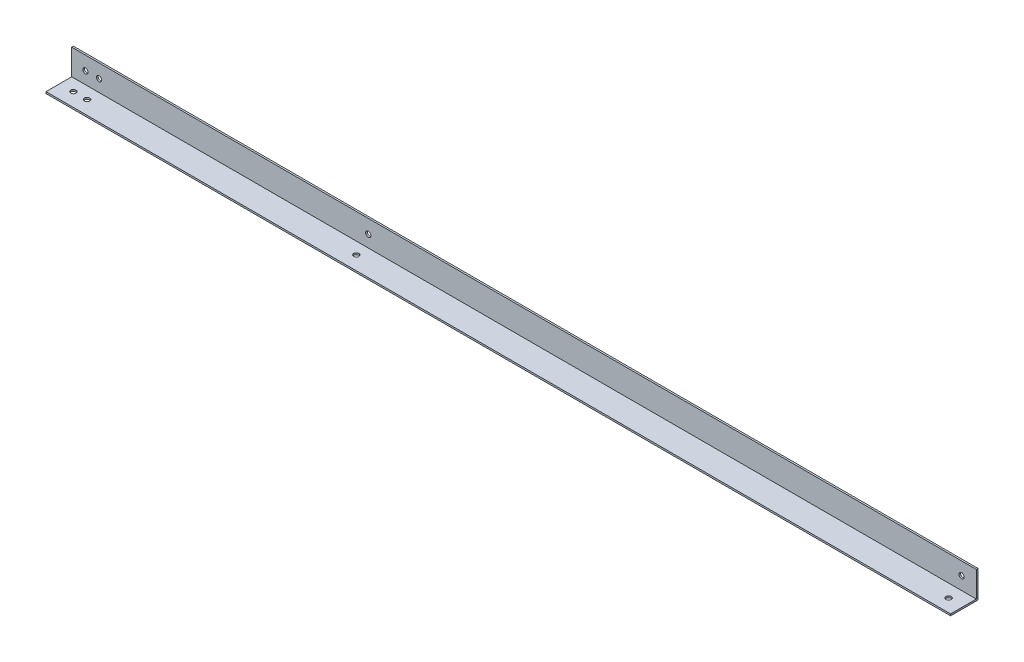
ISO-10303-21;
HEADER;
FILE_DESCRIPTION(('STEP AP214'),'2;1');
FILE_NAME('part.step','',(''),(''),'','','');
FILE_SCHEMA(('AUTOMOTIVE_DESIGN { 1 0 10303 214 1 1 1 1 }'));
ENDSEC;
DATA;
#1=APPLICATION_CONTEXT('core data for automotive mechanical design processes');
#2=APPLICATION_PROTOCOL_DEFINITION('international standard','automotive_design',2000,#1);
#3=PRODUCT_CONTEXT('',#1,'mechanical');
#4=PRODUCT('Part','Part','',(#3));
#5=PRODUCT_RELATED_PRODUCT_CATEGORY('part','',(#4));
#6=PRODUCT_DEFINITION_FORMATION('','',#4);
#7=PRODUCT_DEFINITION_CONTEXT('part definition',#1,'design');
#8=PRODUCT_DEFINITION('design','',#6,#7);
#9=PRODUCT_DEFINITION_SHAPE('','',#8);
#10=(LENGTH_UNIT() NAMED_UNIT(*) SI_UNIT(.MILLI.,.METRE.));
#11=(NAMED_UNIT(*) PLANE_ANGLE_UNIT() SI_UNIT($,.RADIAN.));
#12=(NAMED_UNIT(*) SI_UNIT($,.STERADIAN.) SOLID_ANGLE_UNIT());
#13=UNCERTAINTY_MEASURE_WITH_UNIT(LENGTH_MEASURE(1.E-05),#10,'distance_accuracy_value','');
#14=(GEOMETRIC_REPRESENTATION_CONTEXT(3) GLOBAL_UNCERTAINTY_ASSIGNED_CONTEXT((#13)) GLOBAL_UNIT_ASSIGNED_CONTEXT((#10,
#11,#12)) REPRESENTATION_CONTEXT('',''));
#15=CARTESIAN_POINT('',(0.,0.,0.));
#16=DIRECTION('',(0.,0.,1.));
#17=DIRECTION('',(1.,0.,0.));
#18=AXIS2_PLACEMENT_3D('',#15,#16,#17);
#19=CARTESIAN_POINT('',(419.1,0.,0.));
#20=DIRECTION('',(0.,1.,0.));
#21=DIRECTION('',(0.,0.,1.));
#22=AXIS2_PLACEMENT_3D('',#19,#20,#21);
#23=PLANE('',#22);
#24=CARTESIAN_POINT('',(405.3836057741,0.,13.49375));
#25=DIRECTION('',(0.,1.,0.));
#26=DIRECTION('',(0.,0.,1.));
#27=AXIS2_PLACEMENT_3D('',#24,#25,#26);
#28=CIRCLE('',#27,2.42569999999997);
#29=CARTESIAN_POINT('',(405.3836057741,0.,15.91945));
#30=VERTEX_POINT('',#29);
#31=EDGE_CURVE('E147',#30,#30,#28,.T.);
#32=ORIENTED_EDGE('',*,*,#31,.T.);
#33=EDGE_LOOP('',(#32));
#34=FACE_BOUND('',#33,.T.);
#35=CARTESIAN_POINT('',(-393.7,0.,12.7));
#36=DIRECTION('',(0.,1.,0.));
#37=DIRECTION('',(0.,0.,1.));
#38=AXIS2_PLACEMENT_3D('',#35,#36,#37);
#39=CIRCLE('',#38,2.42569999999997);
#40=CARTESIAN_POINT('',(-393.7,0.,15.1257));
#41=VERTEX_POINT('',#40);
#42=EDGE_CURVE('E172',#41,#41,#39,.T.);
#43=ORIENTED_EDGE('',*,*,#42,.T.);
#44=EDGE_LOOP('',(#43));
#45=FACE_BOUND('',#44,.T.);
#46=CARTESIAN_POINT('',(-144.27708,0.,12.7));
#47=DIRECTION('',(0.,1.,0.));
#48=DIRECTION('',(0.,0.,1.));
#49=AXIS2_PLACEMENT_3D('',#46,#47,#48);
#50=CIRCLE('',#49,2.4257);
#51=CARTESIAN_POINT('',(-144.27708,0.,15.1257));
#52=VERTEX_POINT('',#51);
#53=EDGE_CURVE('E169',#52,#52,#50,.T.);
#54=ORIENTED_EDGE('',*,*,#53,.T.);
#55=EDGE_LOOP('',(#54));
#56=FACE_BOUND('',#55,.T.);
#57=CARTESIAN_POINT('',(-406.4,0.,12.7));
#58=DIRECTION('',(0.,1.,0.));
#59=DIRECTION('',(0.,0.,1.));
#60=AXIS2_PLACEMENT_3D('',#57,#58,#59);
#61=CIRCLE('',#60,2.42569999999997);
#62=CARTESIAN_POINT('',(-406.4,0.,15.1257));
#63=VERTEX_POINT('',#62);
#64=EDGE_CURVE('E164',#63,#63,#61,.T.);
#65=ORIENTED_EDGE('',*,*,#64,.T.);
#66=EDGE_LOOP('',(#65));
#67=FACE_BOUND('',#66,.T.);
#68=DIRECTION('',(0.,0.,-1.));
#69=VECTOR('',#68,1.);
#70=CARTESIAN_POINT('',(-419.1,0.,0.));
#71=LINE('',#70,#69);
#72=CARTESIAN_POINT('',(-419.1,0.,25.4));
#73=VERTEX_POINT('',#72);
#74=CARTESIAN_POINT('',(-419.1,0.,0.));
#75=VERTEX_POINT('',#74);
#76=EDGE_CURVE('E123',#73,#75,#71,.T.);
#77=ORIENTED_EDGE('',*,*,#76,.T.);
#78=DIRECTION('',(-1.,0.,0.));
#79=VECTOR('',#78,1.);
#80=CARTESIAN_POINT('',(419.1,0.,0.));
#81=LINE('',#80,#79);
#82=CARTESIAN_POINT('',(419.1,0.,0.));
#83=VERTEX_POINT('',#82);
#84=EDGE_CURVE('E11',#83,#75,#81,.T.);
#85=ORIENTED_EDGE('',*,*,#84,.F.);
#86=DIRECTION('',(0.,0.,-1.));
#87=VECTOR('',#86,1.);
#88=CARTESIAN_POINT('',(419.1,0.,0.));
#89=LINE('',#88,#87);
#90=CARTESIAN_POINT('',(419.1,0.,25.4));
#91=VERTEX_POINT('',#90);
#92=EDGE_CURVE('E138',#91,#83,#89,.T.);
#93=ORIENTED_EDGE('',*,*,#92,.F.);
#94=DIRECTION('',(-1.,0.,0.));
#95=VECTOR('',#94,1.);
#96=CARTESIAN_POINT('',(419.1,0.,25.4));
#97=LINE('',#96,#95);
#98=EDGE_CURVE('E122',#91,#73,#97,.T.);
#99=ORIENTED_EDGE('',*,*,#98,.T.);
#100=EDGE_LOOP('',(#77,#85,#93,#99));
#101=FACE_BOUND('',#100,.T.);
#102=ADVANCED_FACE('F39',(#34,#45,#56,#67,#101),#23,.F.);
#103=CARTESIAN_POINT('',(419.1,0.,0.));
#104=DIRECTION('',(0.,0.,1.));
#105=DIRECTION('',(1.,0.,0.));
#106=AXIS2_PLACEMENT_3D('',#103,#104,#105);
#107=PLANE('',#106);
#108=CARTESIAN_POINT('',(405.3836057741,13.49375,0.));
#109=DIRECTION('',(0.,0.,-1.));
#110=DIRECTION('',(0.,1.,0.));
#111=AXIS2_PLACEMENT_3D('',#108,#109,#110);
#112=CIRCLE('',#111,2.42569999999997);
#113=CARTESIAN_POINT('',(405.3836057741,15.91945,0.));
#114=VERTEX_POINT('',#113);
#115=EDGE_CURVE('E156',#114,#114,#112,.T.);
#116=ORIENTED_EDGE('',*,*,#115,.F.);
#117=EDGE_LOOP('',(#116));
#118=FACE_BOUND('',#117,.T.);
#119=CARTESIAN_POINT('',(-393.7,12.7,0.));
#120=DIRECTION('',(0.,0.,-1.));
#121=DIRECTION('',(0.,1.,0.));
#122=AXIS2_PLACEMENT_3D('',#119,#120,#121);
#123=CIRCLE('',#122,2.42569999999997);
#124=CARTESIAN_POINT('',(-393.7,15.1257,0.));
#125=VERTEX_POINT('',#124);
#126=EDGE_CURVE('E258',#125,#125,#123,.T.);
#127=ORIENTED_EDGE('',*,*,#126,.F.);
#128=EDGE_LOOP('',(#127));
#129=FACE_BOUND('',#128,.T.);
#130=CARTESIAN_POINT('',(-144.27708,12.7,0.));
#131=DIRECTION('',(0.,0.,-1.));
#132=DIRECTION('',(0.,1.,0.));
#133=AXIS2_PLACEMENT_3D('',#130,#131,#132);
#134=CIRCLE('',#133,2.4257);
#135=CARTESIAN_POINT('',(-144.27708,15.1257,0.));
#136=VERTEX_POINT('',#135);
#137=EDGE_CURVE('E263',#136,#136,#134,.T.);
#138=ORIENTED_EDGE('',*,*,#137,.F.);
#139=EDGE_LOOP('',(#138));
#140=FACE_BOUND('',#139,.T.);
#141=CARTESIAN_POINT('',(-406.4,12.7,0.));
#142=DIRECTION('',(0.,0.,-1.));
#143=DIRECTION('',(0.,1.,0.));
#144=AXIS2_PLACEMENT_3D('',#141,#142,#143);
#145=CIRCLE('',#144,2.42569999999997);
#146=CARTESIAN_POINT('',(-406.4,15.1257,0.));
#147=VERTEX_POINT('',#146);
#148=EDGE_CURVE('E266',#147,#147,#145,.T.);
#149=ORIENTED_EDGE('',*,*,#148,.F.);
#150=EDGE_LOOP('',(#149));
#151=FACE_BOUND('',#150,.T.);
#152=DIRECTION('',(0.,1.,0.));
#153=VECTOR('',#152,1.);
#154=CARTESIAN_POINT('',(-419.1,0.,0.));
#155=LINE('',#154,#153);
#156=CARTESIAN_POINT('',(-419.1,25.4,0.));
#157=VERTEX_POINT('',#156);
#158=EDGE_CURVE('E129',#75,#157,#155,.T.);
#159=ORIENTED_EDGE('',*,*,#158,.T.);
#160=DIRECTION('',(-1.,0.,0.));
#161=VECTOR('',#160,1.);
#162=CARTESIAN_POINT('',(419.1,25.4,0.));
#163=LINE('',#162,#161);
#164=CARTESIAN_POINT('',(419.1,25.4,0.));
#165=VERTEX_POINT('',#164);
#166=EDGE_CURVE('E48',#165,#157,#163,.T.);
#167=ORIENTED_EDGE('',*,*,#166,.F.);
#168=DIRECTION('',(0.,1.,0.));
#169=VECTOR('',#168,1.);
#170=CARTESIAN_POINT('',(419.1,0.,0.));
#171=LINE('',#170,#169);
#172=EDGE_CURVE('E94',#83,#165,#171,.T.);
#173=ORIENTED_EDGE('',*,*,#172,.F.);
#174=ORIENTED_EDGE('',*,*,#84,.T.);
#175=EDGE_LOOP('',(#159,#167,#173,#174));
#176=FACE_BOUND('',#175,.T.);
#177=ADVANCED_FACE('F181',(#118,#129,#140,#151,#176),#107,.F.);
#178=CARTESIAN_POINT('',(419.1,25.4,0.));
#179=DIRECTION('',(0.,-1.,0.));
#180=DIRECTION('',(0.,0.,-1.));
#181=AXIS2_PLACEMENT_3D('',#178,#179,#180);
#182=PLANE('',#181);
#183=DIRECTION('',(0.,0.,1.));
#184=VECTOR('',#183,1.);
#185=CARTESIAN_POINT('',(-419.1,25.4,0.));
#186=LINE('',#185,#184);
#187=CARTESIAN_POINT('',(-419.1,25.4,1.5875));
#188=VERTEX_POINT('',#187);
#189=EDGE_CURVE('E132',#157,#188,#186,.T.);
#190=ORIENTED_EDGE('',*,*,#189,.T.);
#191=DIRECTION('',(-1.,0.,0.));
#192=VECTOR('',#191,1.);
#193=CARTESIAN_POINT('',(419.1,25.4,1.5875));
#194=LINE('',#193,#192);
#195=CARTESIAN_POINT('',(419.1,25.4,1.5875));
#196=VERTEX_POINT('',#195);
#197=EDGE_CURVE('E116',#196,#188,#194,.T.);
#198=ORIENTED_EDGE('',*,*,#197,.F.);
#199=DIRECTION('',(0.,0.,1.));
#200=VECTOR('',#199,1.);
#201=CARTESIAN_POINT('',(419.1,25.4,0.));
#202=LINE('',#201,#200);
#203=EDGE_CURVE('E110',#165,#196,#202,.T.);
#204=ORIENTED_EDGE('',*,*,#203,.F.);
#205=ORIENTED_EDGE('',*,*,#166,.T.);
#206=EDGE_LOOP('',(#190,#198,#204,#205));
#207=FACE_BOUND('',#206,.T.);
#208=ADVANCED_FACE('F183',(#207),#182,.F.);
#209=CARTESIAN_POINT('',(419.1,1.5875,1.5875));
#210=DIRECTION('',(0.,0.,-1.));
#211=DIRECTION('',(-1.,0.,0.));
#212=AXIS2_PLACEMENT_3D('',#209,#210,#211);
#213=PLANE('',#212);
#214=CARTESIAN_POINT('',(405.3836057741,13.49375,1.5875));
#215=DIRECTION('',(0.,0.,-1.));
#216=DIRECTION('',(-1.,0.,0.));
#217=AXIS2_PLACEMENT_3D('',#214,#215,#216);
#218=CIRCLE('',#217,2.42569999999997);
#219=CARTESIAN_POINT('',(402.9579057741,13.49375,1.5875));
#220=VERTEX_POINT('',#219);
#221=EDGE_CURVE('E45',#220,#220,#218,.T.);
#222=ORIENTED_EDGE('',*,*,#221,.T.);
#223=EDGE_LOOP('',(#222));
#224=FACE_BOUND('',#223,.T.);
#225=CARTESIAN_POINT('',(-393.7,12.7,1.5875));
#226=DIRECTION('',(0.,0.,-1.));
#227=DIRECTION('',(-1.,0.,0.));
#228=AXIS2_PLACEMENT_3D('',#225,#226,#227);
#229=CIRCLE('',#228,2.42569999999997);
#230=CARTESIAN_POINT('',(-396.1257,12.7,1.5875));
#231=VERTEX_POINT('',#230);
#232=EDGE_CURVE('E157',#231,#231,#229,.T.);
#233=ORIENTED_EDGE('',*,*,#232,.T.);
#234=EDGE_LOOP('',(#233));
#235=FACE_BOUND('',#234,.T.);
#236=CARTESIAN_POINT('',(-144.27708,12.7,1.5875));
#237=DIRECTION('',(0.,0.,-1.));
#238=DIRECTION('',(-1.,0.,0.));
#239=AXIS2_PLACEMENT_3D('',#236,#237,#238);
#240=CIRCLE('',#239,2.4257);
#241=CARTESIAN_POINT('',(-146.70278,12.7,1.5875));
#242=VERTEX_POINT('',#241);
#243=EDGE_CURVE('E160',#242,#242,#240,.T.);
#244=ORIENTED_EDGE('',*,*,#243,.T.);
#245=EDGE_LOOP('',(#244));
#246=FACE_BOUND('',#245,.T.);
#247=CARTESIAN_POINT('',(-406.4,12.7,1.5875));
#248=DIRECTION('',(0.,0.,-1.));
#249=DIRECTION('',(-1.,0.,0.));
#250=AXIS2_PLACEMENT_3D('',#247,#248,#249);
#251=CIRCLE('',#250,2.42569999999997);
#252=CARTESIAN_POINT('',(-408.8257,12.7,1.5875));
#253=VERTEX_POINT('',#252);
#254=EDGE_CURVE('E154',#253,#253,#251,.T.);
#255=ORIENTED_EDGE('',*,*,#254,.T.);
#256=EDGE_LOOP('',(#255));
#257=FACE_BOUND('',#256,.T.);
#258=DIRECTION('',(0.,-1.,0.));
#259=VECTOR('',#258,1.);
#260=CARTESIAN_POINT('',(-419.1,1.5875,1.5875));
#261=LINE('',#260,#259);
#262=CARTESIAN_POINT('',(-419.1,1.5875,1.5875));
#263=VERTEX_POINT('',#262);
#264=EDGE_CURVE('E114',#188,#263,#261,.T.);
#265=ORIENTED_EDGE('',*,*,#264,.T.);
#266=DIRECTION('',(-1.,0.,0.));
#267=VECTOR('',#266,1.);
#268=CARTESIAN_POINT('',(419.1,1.5875,1.5875));
#269=LINE('',#268,#267);
#270=CARTESIAN_POINT('',(419.1,1.5875,1.5875));
#271=VERTEX_POINT('',#270);
#272=EDGE_CURVE('E115',#271,#263,#269,.T.);
#273=ORIENTED_EDGE('',*,*,#272,.F.);
#274=DIRECTION('',(0.,-1.,0.));
#275=VECTOR('',#274,1.);
#276=CARTESIAN_POINT('',(419.1,1.5875,1.5875));
#277=LINE('',#276,#275);
#278=EDGE_CURVE('E103',#196,#271,#277,.T.);
#279=ORIENTED_EDGE('',*,*,#278,.F.);
#280=ORIENTED_EDGE('',*,*,#197,.T.);
#281=EDGE_LOOP('',(#265,#273,#279,#280));
#282=FACE_BOUND('',#281,.T.);
#283=ADVANCED_FACE('F113',(#224,#235,#246,#257,#282),#213,.F.);
#284=CARTESIAN_POINT('',(419.1,1.5875,1.5875));
#285=DIRECTION('',(0.,-1.,0.));
#286=DIRECTION('',(0.,0.,-1.));
#287=AXIS2_PLACEMENT_3D('',#284,#285,#286);
#288=PLANE('',#287);
#289=CARTESIAN_POINT('',(405.3836057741,1.5875,13.49375));
#290=DIRECTION('',(0.,-1.,0.));
#291=DIRECTION('',(0.,0.,-1.));
#292=AXIS2_PLACEMENT_3D('',#289,#290,#291);
#293=CIRCLE('',#292,2.42569999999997);
#294=CARTESIAN_POINT('',(405.3836057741,1.5875,11.06805));
#295=VERTEX_POINT('',#294);
#296=EDGE_CURVE('E126',#295,#295,#293,.F.);
#297=ORIENTED_EDGE('',*,*,#296,.F.);
#298=EDGE_LOOP('',(#297));
#299=FACE_BOUND('',#298,.T.);
#300=CARTESIAN_POINT('',(-393.7,1.5875,12.7));
#301=DIRECTION('',(0.,-1.,0.));
#302=DIRECTION('',(0.,0.,-1.));
#303=AXIS2_PLACEMENT_3D('',#300,#301,#302);
#304=CIRCLE('',#303,2.42569999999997);
#305=CARTESIAN_POINT('',(-393.7,1.5875,10.2743));
#306=VERTEX_POINT('',#305);
#307=EDGE_CURVE('E146',#306,#306,#304,.F.);
#308=ORIENTED_EDGE('',*,*,#307,.F.);
#309=EDGE_LOOP('',(#308));
#310=FACE_BOUND('',#309,.T.);
#311=CARTESIAN_POINT('',(-144.27708,1.5875,12.7));
#312=DIRECTION('',(0.,-1.,0.));
#313=DIRECTION('',(0.,0.,-1.));
#314=AXIS2_PLACEMENT_3D('',#311,#312,#313);
#315=CIRCLE('',#314,2.4257);
#316=CARTESIAN_POINT('',(-144.27708,1.5875,10.2743));
#317=VERTEX_POINT('',#316);
#318=EDGE_CURVE('E143',#317,#317,#315,.F.);
#319=ORIENTED_EDGE('',*,*,#318,.F.);
#320=EDGE_LOOP('',(#319));
#321=FACE_BOUND('',#320,.T.);
#322=CARTESIAN_POINT('',(-406.4,1.5875,12.7));
#323=DIRECTION('',(0.,-1.,0.));
#324=DIRECTION('',(0.,0.,-1.));
#325=AXIS2_PLACEMENT_3D('',#322,#323,#324);
#326=CIRCLE('',#325,2.42569999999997);
#327=CARTESIAN_POINT('',(-406.4,1.5875,10.2743));
#328=VERTEX_POINT('',#327);
#329=EDGE_CURVE('E145',#328,#328,#326,.F.);
#330=ORIENTED_EDGE('',*,*,#329,.F.);
#331=EDGE_LOOP('',(#330));
#332=FACE_BOUND('',#331,.T.);
#333=DIRECTION('',(0.,0.,1.));
#334=VECTOR('',#333,1.);
#335=CARTESIAN_POINT('',(-419.1,1.5875,1.5875));
#336=LINE('',#335,#334);
#337=CARTESIAN_POINT('',(-419.1,1.5875,25.4));
#338=VERTEX_POINT('',#337);
#339=EDGE_CURVE('E78',#263,#338,#336,.T.);
#340=ORIENTED_EDGE('',*,*,#339,.T.);
#341=DIRECTION('',(-1.,0.,0.));
#342=VECTOR('',#341,1.);
#343=CARTESIAN_POINT('',(419.1,1.5875,25.4));
#344=LINE('',#343,#342);
#345=CARTESIAN_POINT('',(419.1,1.5875,25.4));
#346=VERTEX_POINT('',#345);
#347=EDGE_CURVE('E120',#346,#338,#344,.T.);
#348=ORIENTED_EDGE('',*,*,#347,.F.);
#349=DIRECTION('',(0.,0.,1.));
#350=VECTOR('',#349,1.);
#351=CARTESIAN_POINT('',(419.1,1.5875,1.5875));
#352=LINE('',#351,#350);
#353=EDGE_CURVE('E102',#271,#346,#352,.T.);
#354=ORIENTED_EDGE('',*,*,#353,.F.);
#355=ORIENTED_EDGE('',*,*,#272,.T.);
#356=EDGE_LOOP('',(#340,#348,#354,#355));
#357=FACE_BOUND('',#356,.T.);
#358=ADVANCED_FACE('F118',(#299,#310,#321,#332,#357),#288,.F.);
#359=CARTESIAN_POINT('',(419.1,0.,25.4));
#360=DIRECTION('',(0.,0.,-1.));
#361=DIRECTION('',(-1.,0.,0.));
#362=AXIS2_PLACEMENT_3D('',#359,#360,#361);
#363=PLANE('',#362);
#364=DIRECTION('',(0.,-1.,0.));
#365=VECTOR('',#364,1.);
#366=CARTESIAN_POINT('',(-419.1,0.,25.4));
#367=LINE('',#366,#365);
#368=EDGE_CURVE('E87',#338,#73,#367,.T.);
#369=ORIENTED_EDGE('',*,*,#368,.T.);
#370=ORIENTED_EDGE('',*,*,#98,.F.);
#371=DIRECTION('',(0.,-1.,0.));
#372=VECTOR('',#371,1.);
#373=CARTESIAN_POINT('',(419.1,0.,25.4));
#374=LINE('',#373,#372);
#375=EDGE_CURVE('E60',#346,#91,#374,.T.);
#376=ORIENTED_EDGE('',*,*,#375,.F.);
#377=ORIENTED_EDGE('',*,*,#347,.T.);
#378=EDGE_LOOP('',(#369,#370,#376,#377));
#379=FACE_BOUND('',#378,.T.);
#380=ADVANCED_FACE('F186',(#379),#363,.F.);
#381=CARTESIAN_POINT('',(419.1,0.,0.));
#382=DIRECTION('',(-1.,0.,0.));
#383=DIRECTION('',(0.,0.,1.));
#384=AXIS2_PLACEMENT_3D('',#381,#382,#383);
#385=PLANE('',#384);
#386=ORIENTED_EDGE('',*,*,#92,.T.);
#387=ORIENTED_EDGE('',*,*,#172,.T.);
#388=ORIENTED_EDGE('',*,*,#203,.T.);
#389=ORIENTED_EDGE('',*,*,#278,.T.);
#390=ORIENTED_EDGE('',*,*,#353,.T.);
#391=ORIENTED_EDGE('',*,*,#375,.T.);
#392=EDGE_LOOP('',(#386,#387,#388,#389,#390,#391));
#393=FACE_BOUND('',#392,.T.);
#394=ADVANCED_FACE('F101',(#393),#385,.F.);
#395=CARTESIAN_POINT('',(-419.1,0.,0.));
#396=DIRECTION('',(-1.,0.,0.));
#397=DIRECTION('',(0.,0.,1.));
#398=AXIS2_PLACEMENT_3D('',#395,#396,#397);
#399=PLANE('',#398);
#400=ORIENTED_EDGE('',*,*,#76,.F.);
#401=ORIENTED_EDGE('',*,*,#368,.F.);
#402=ORIENTED_EDGE('',*,*,#339,.F.);
#403=ORIENTED_EDGE('',*,*,#264,.F.);
#404=ORIENTED_EDGE('',*,*,#189,.F.);
#405=ORIENTED_EDGE('',*,*,#158,.F.);
#406=EDGE_LOOP('',(#400,#401,#402,#403,#404,#405));
#407=FACE_BOUND('',#406,.T.);
#408=ADVANCED_FACE('F190',(#407),#399,.T.);
#409=CARTESIAN_POINT('',(-406.4,25.4,12.7));
#410=DIRECTION('',(0.,-1.,0.));
#411=DIRECTION('',(0.,0.,-1.));
#412=AXIS2_PLACEMENT_3D('',#409,#410,#411);
#413=CYLINDRICAL_SURFACE('',#412,2.42569999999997);
#414=ORIENTED_EDGE('',*,*,#64,.F.);
#415=EDGE_LOOP('',(#414));
#416=FACE_BOUND('',#415,.T.);
#417=ORIENTED_EDGE('',*,*,#329,.T.);
#418=EDGE_LOOP('',(#417));
#419=FACE_BOUND('',#418,.T.);
#420=ADVANCED_FACE('F216',(#416,#419),#413,.F.);
#421=CARTESIAN_POINT('',(-144.27708,25.4,12.7));
#422=DIRECTION('',(0.,-1.,0.));
#423=DIRECTION('',(0.,0.,-1.));
#424=AXIS2_PLACEMENT_3D('',#421,#422,#423);
#425=CYLINDRICAL_SURFACE('',#424,2.4257);
#426=ORIENTED_EDGE('',*,*,#53,.F.);
#427=EDGE_LOOP('',(#426));
#428=FACE_BOUND('',#427,.T.);
#429=ORIENTED_EDGE('',*,*,#318,.T.);
#430=EDGE_LOOP('',(#429));
#431=FACE_BOUND('',#430,.T.);
#432=ADVANCED_FACE('F217',(#428,#431),#425,.F.);
#433=CARTESIAN_POINT('',(-393.7,25.4,12.7));
#434=DIRECTION('',(0.,-1.,0.));
#435=DIRECTION('',(0.,0.,-1.));
#436=AXIS2_PLACEMENT_3D('',#433,#434,#435);
#437=CYLINDRICAL_SURFACE('',#436,2.42569999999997);
#438=ORIENTED_EDGE('',*,*,#42,.F.);
#439=EDGE_LOOP('',(#438));
#440=FACE_BOUND('',#439,.T.);
#441=ORIENTED_EDGE('',*,*,#307,.T.);
#442=EDGE_LOOP('',(#441));
#443=FACE_BOUND('',#442,.T.);
#444=ADVANCED_FACE('F219',(#440,#443),#437,.F.);
#445=CARTESIAN_POINT('',(405.3836057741,25.4,13.49375));
#446=DIRECTION('',(0.,-1.,0.));
#447=DIRECTION('',(0.,0.,-1.));
#448=AXIS2_PLACEMENT_3D('',#445,#446,#447);
#449=CYLINDRICAL_SURFACE('',#448,2.42569999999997);
#450=ORIENTED_EDGE('',*,*,#31,.F.);
#451=EDGE_LOOP('',(#450));
#452=FACE_BOUND('',#451,.T.);
#453=ORIENTED_EDGE('',*,*,#296,.T.);
#454=EDGE_LOOP('',(#453));
#455=FACE_BOUND('',#454,.T.);
#456=ADVANCED_FACE('F232',(#452,#455),#449,.F.);
#457=CARTESIAN_POINT('',(-406.4,12.7,25.4));
#458=DIRECTION('',(0.,0.,-1.));
#459=DIRECTION('',(0.,1.,0.));
#460=AXIS2_PLACEMENT_3D('',#457,#458,#459);
#461=CYLINDRICAL_SURFACE('',#460,2.42569999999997);
#462=ORIENTED_EDGE('',*,*,#148,.T.);
#463=EDGE_LOOP('',(#462));
#464=FACE_BOUND('',#463,.T.);
#465=ORIENTED_EDGE('',*,*,#254,.F.);
#466=EDGE_LOOP('',(#465));
#467=FACE_BOUND('',#466,.T.);
#468=ADVANCED_FACE('F237',(#464,#467),#461,.F.);
#469=CARTESIAN_POINT('',(-144.27708,12.7,25.4));
#470=DIRECTION('',(0.,0.,-1.));
#471=DIRECTION('',(0.,1.,0.));
#472=AXIS2_PLACEMENT_3D('',#469,#470,#471);
#473=CYLINDRICAL_SURFACE('',#472,2.4257);
#474=ORIENTED_EDGE('',*,*,#137,.T.);
#475=EDGE_LOOP('',(#474));
#476=FACE_BOUND('',#475,.T.);
#477=ORIENTED_EDGE('',*,*,#243,.F.);
#478=EDGE_LOOP('',(#477));
#479=FACE_BOUND('',#478,.T.);
#480=ADVANCED_FACE('F243',(#476,#479),#473,.F.);
#481=CARTESIAN_POINT('',(-393.7,12.7,25.4));
#482=DIRECTION('',(0.,0.,-1.));
#483=DIRECTION('',(0.,1.,0.));
#484=AXIS2_PLACEMENT_3D('',#481,#482,#483);
#485=CYLINDRICAL_SURFACE('',#484,2.42569999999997);
#486=ORIENTED_EDGE('',*,*,#126,.T.);
#487=EDGE_LOOP('',(#486));
#488=FACE_BOUND('',#487,.T.);
#489=ORIENTED_EDGE('',*,*,#232,.F.);
#490=EDGE_LOOP('',(#489));
#491=FACE_BOUND('',#490,.T.);
#492=ADVANCED_FACE('F250',(#488,#491),#485,.F.);
#493=CARTESIAN_POINT('',(405.3836057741,13.49375,25.4));
#494=DIRECTION('',(0.,0.,-1.));
#495=DIRECTION('',(0.,1.,0.));
#496=AXIS2_PLACEMENT_3D('',#493,#494,#495);
#497=CYLINDRICAL_SURFACE('',#496,2.42569999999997);
#498=ORIENTED_EDGE('',*,*,#115,.T.);
#499=EDGE_LOOP('',(#498));
#500=FACE_BOUND('',#499,.T.);
#501=ORIENTED_EDGE('',*,*,#221,.F.);
#502=EDGE_LOOP('',(#501));
#503=FACE_BOUND('',#502,.T.);
#504=ADVANCED_FACE('F252',(#500,#503),#497,.F.);
#505=CLOSED_SHELL('',(#102,#177,#208,#283,#358,#380,#394,#408,#420,#432,#444,#456,#468,#480,
#492,#504));
#506=MANIFOLD_SOLID_BREP('B2',#505);
#507=ADVANCED_BREP_SHAPE_REPRESENTATION('',(#18,#506),#14);
#508=SHAPE_DEFINITION_REPRESENTATION(#9,#507);
ENDSEC;
END-ISO-10303-21;
